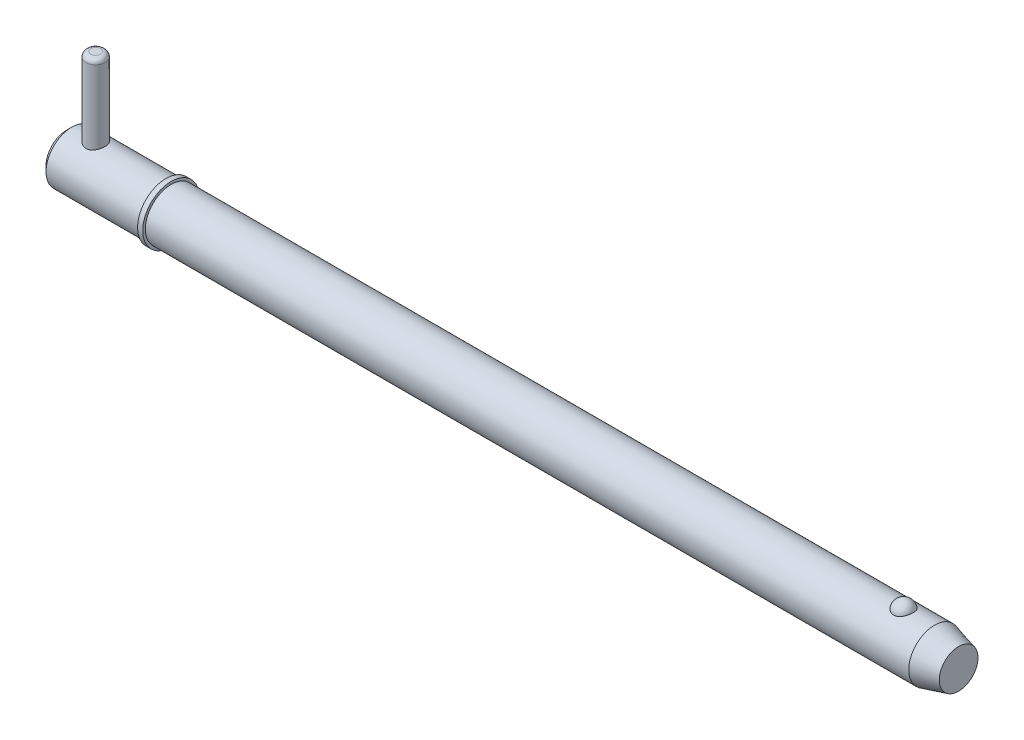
ISO-10303-21;
HEADER;
FILE_DESCRIPTION(('STEP AP214'),'2;1');
FILE_NAME('part.step','',(''),(''),'','','');
FILE_SCHEMA(('AUTOMOTIVE_DESIGN { 1 0 10303 214 1 1 1 1 }'));
ENDSEC;
DATA;
#1=APPLICATION_CONTEXT('core data for automotive mechanical design processes');
#2=APPLICATION_PROTOCOL_DEFINITION('international standard','automotive_design',2000,#1);
#3=PRODUCT_CONTEXT('',#1,'mechanical');
#4=PRODUCT('Part','Part','',(#3));
#5=PRODUCT_RELATED_PRODUCT_CATEGORY('part','',(#4));
#6=PRODUCT_DEFINITION_FORMATION('','',#4);
#7=PRODUCT_DEFINITION_CONTEXT('part definition',#1,'design');
#8=PRODUCT_DEFINITION('design','',#6,#7);
#9=PRODUCT_DEFINITION_SHAPE('','',#8);
#10=(LENGTH_UNIT() NAMED_UNIT(*) SI_UNIT(.MILLI.,.METRE.));
#11=(NAMED_UNIT(*) PLANE_ANGLE_UNIT() SI_UNIT($,.RADIAN.));
#12=(NAMED_UNIT(*) SI_UNIT($,.STERADIAN.) SOLID_ANGLE_UNIT());
#13=UNCERTAINTY_MEASURE_WITH_UNIT(LENGTH_MEASURE(1.E-05),#10,'distance_accuracy_value','');
#14=(GEOMETRIC_REPRESENTATION_CONTEXT(3) GLOBAL_UNCERTAINTY_ASSIGNED_CONTEXT((#13)) GLOBAL_UNIT_ASSIGNED_CONTEXT((#10,
#11,#12)) REPRESENTATION_CONTEXT('',''));
#15=CARTESIAN_POINT('',(0.,0.,0.));
#16=DIRECTION('',(0.,0.,1.));
#17=DIRECTION('',(1.,0.,0.));
#18=AXIS2_PLACEMENT_3D('',#15,#16,#17);
#19=CARTESIAN_POINT('',(7.14,25.4,0.));
#20=DIRECTION('',(0.,-1.,0.));
#21=DIRECTION('',(0.,0.,-1.));
#22=AXIS2_PLACEMENT_3D('',#19,#20,#21);
#23=CYLINDRICAL_SURFACE('',#22,2.38);
#24=CARTESIAN_POINT('',(7.14,-5.16,0.));
#25=DIRECTION('',(0.,1.,0.));
#26=DIRECTION('',(0.,0.,1.));
#27=AXIS2_PLACEMENT_3D('',#24,#25,#26);
#28=CIRCLE('',#27,2.38);
#29=CARTESIAN_POINT('',(7.14,-5.16,2.38));
#30=VERTEX_POINT('',#29);
#31=EDGE_CURVE('P0_E25',#30,#30,#28,.T.);
#32=ORIENTED_EDGE('',*,*,#31,.T.);
#33=EDGE_LOOP('',(#32));
#34=FACE_BOUND('',#33,.T.);
#35=CARTESIAN_POINT('',(7.14,24.21,0.));
#36=DIRECTION('',(0.,1.,0.));
#37=DIRECTION('',(0.,0.,1.));
#38=AXIS2_PLACEMENT_3D('',#35,#36,#37);
#39=CIRCLE('',#38,2.38);
#40=CARTESIAN_POINT('',(7.14,24.21,2.38));
#41=VERTEX_POINT('',#40);
#42=EDGE_CURVE('P0_E29',#41,#41,#39,.F.);
#43=ORIENTED_EDGE('',*,*,#42,.T.);
#44=EDGE_LOOP('',(#43));
#45=FACE_BOUND('',#44,.T.);
#46=ADVANCED_FACE('P0_F14',(#34,#45),#23,.T.);
#47=CARTESIAN_POINT('',(7.14,25.4,0.));
#48=DIRECTION('',(0.,1.,0.));
#49=DIRECTION('',(0.,0.,1.));
#50=AXIS2_PLACEMENT_3D('',#47,#48,#49);
#51=PLANE('',#50);
#52=CARTESIAN_POINT('',(7.14,25.4,0.));
#53=DIRECTION('',(0.,1.,0.));
#54=DIRECTION('',(0.,0.,1.));
#55=AXIS2_PLACEMENT_3D('',#52,#53,#54);
#56=CIRCLE('',#55,1.19);
#57=CARTESIAN_POINT('',(7.14,25.4,1.19));
#58=VERTEX_POINT('',#57);
#59=EDGE_CURVE('P0_E10',#58,#58,#56,.T.);
#60=ORIENTED_EDGE('',*,*,#59,.T.);
#61=EDGE_LOOP('',(#60));
#62=FACE_BOUND('',#61,.T.);
#63=ADVANCED_FACE('P0_F46',(#62),#51,.T.);
#64=CARTESIAN_POINT('',(7.14,-6.35,0.));
#65=DIRECTION('',(0.,1.,0.));
#66=DIRECTION('',(0.,0.,1.));
#67=AXIS2_PLACEMENT_3D('',#64,#65,#66);
#68=PLANE('',#67);
#69=CARTESIAN_POINT('',(7.14,-6.35,0.));
#70=DIRECTION('',(0.,1.,0.));
#71=DIRECTION('',(0.,0.,1.));
#72=AXIS2_PLACEMENT_3D('',#69,#70,#71);
#73=CIRCLE('',#72,1.19);
#74=CARTESIAN_POINT('',(7.14,-6.35,1.19));
#75=VERTEX_POINT('',#74);
#76=EDGE_CURVE('P0_E21',#75,#75,#73,.F.);
#77=ORIENTED_EDGE('',*,*,#76,.T.);
#78=EDGE_LOOP('',(#77));
#79=FACE_BOUND('',#78,.T.);
#80=ADVANCED_FACE('P0_F43',(#79),#68,.F.);
#81=CARTESIAN_POINT('',(7.14,-5.16,0.));
#82=DIRECTION('',(0.,1.,0.));
#83=DIRECTION('',(0.,0.,1.));
#84=AXIS2_PLACEMENT_3D('',#81,#82,#83);
#85=DEGENERATE_TOROIDAL_SURFACE('',#84,1.19,1.19,.T.);
#86=ORIENTED_EDGE('',*,*,#76,.F.);
#87=EDGE_LOOP('',(#86));
#88=FACE_BOUND('',#87,.T.);
#89=ORIENTED_EDGE('',*,*,#31,.F.);
#90=EDGE_LOOP('',(#89));
#91=FACE_BOUND('',#90,.T.);
#92=ADVANCED_FACE('P0_F38',(#88,#91),#85,.T.);
#93=CARTESIAN_POINT('',(7.14,24.21,0.));
#94=DIRECTION('',(0.,1.,0.));
#95=DIRECTION('',(0.,0.,1.));
#96=AXIS2_PLACEMENT_3D('',#93,#94,#95);
#97=DEGENERATE_TOROIDAL_SURFACE('',#96,1.19,1.19,.T.);
#98=ORIENTED_EDGE('',*,*,#42,.F.);
#99=EDGE_LOOP('',(#98));
#100=FACE_BOUND('',#99,.T.);
#101=ORIENTED_EDGE('',*,*,#59,.F.);
#102=EDGE_LOOP('',(#101));
#103=FACE_BOUND('',#102,.T.);
#104=ADVANCED_FACE('P0_F16',(#100,#103),#97,.T.);
#105=CLOSED_SHELL('',(#46,#63,#80,#92,#104));
#106=MANIFOLD_SOLID_BREP('P0_B1',#105);
#107=CARTESIAN_POINT('',(0.,0.,0.));
#108=DIRECTION('',(1.,0.,0.));
#109=DIRECTION('',(0.,0.,-1.));
#110=AXIS2_PLACEMENT_3D('',#107,#108,#109);
#111=CYLINDRICAL_SURFACE('',#110,6.35);
#112=CARTESIAN_POINT('',(213.455369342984,0.,0.));
#113=DIRECTION('',(1.,0.,0.));
#114=DIRECTION('',(0.,0.,-1.));
#115=AXIS2_PLACEMENT_3D('',#112,#113,#114);
#116=CIRCLE('',#115,6.35);
#117=CARTESIAN_POINT('',(213.455369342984,0.,-6.35));
#118=VERTEX_POINT('',#117);
#119=EDGE_CURVE('P1_E81',#118,#118,#116,.T.);
#120=ORIENTED_EDGE('',*,*,#119,.F.);
#121=EDGE_LOOP('',(#120));
#122=FACE_BOUND('',#121,.T.);
#123=CARTESIAN_POINT('',(25.7,0.,0.));
#124=DIRECTION('',(1.,0.,0.));
#125=DIRECTION('',(0.,0.,-1.));
#126=AXIS2_PLACEMENT_3D('',#123,#124,#125);
#127=CIRCLE('',#126,6.35);
#128=CARTESIAN_POINT('',(25.7,0.,-6.35));
#129=VERTEX_POINT('',#128);
#130=EDGE_CURVE('P1_E85',#129,#129,#127,.T.);
#131=ORIENTED_EDGE('',*,*,#130,.T.);
#132=EDGE_LOOP('',(#131));
#133=FACE_BOUND('',#132,.T.);
#134=CARTESIAN_POINT('',(205.830021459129,5.87502187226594,2.40969251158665));
#135=CARTESIAN_POINT('',(205.705030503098,5.87501645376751,2.40969773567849));
#136=CARTESIAN_POINT('',(205.580080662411,5.87916061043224,2.39967292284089));
#137=CARTESIAN_POINT('',(205.333909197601,5.89523112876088,2.35991730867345));
#138=CARTESIAN_POINT('',(205.212686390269,5.90715499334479,2.33019283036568));
#139=CARTESIAN_POINT('',(204.977517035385,5.93739567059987,2.25201402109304));
#140=CARTESIAN_POINT('',(204.863560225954,5.95570321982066,2.20358681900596));
#141=CARTESIAN_POINT('',(204.64557352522,5.99672067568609,2.08937987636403));
#142=CARTESIAN_POINT('',(204.541545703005,6.0194314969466,2.02359652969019));
#143=CARTESIAN_POINT('',(204.342943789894,6.06760647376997,1.87428969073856));
#144=CARTESIAN_POINT('',(204.248726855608,6.09313095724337,1.79031110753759));
#145=CARTESIAN_POINT('',(204.075255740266,6.14375873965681,1.6080017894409));
#146=CARTESIAN_POINT('',(203.996004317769,6.16886196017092,1.50966841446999));
#147=CARTESIAN_POINT('',(203.850845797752,6.21724600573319,1.29645884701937));
#148=CARTESIAN_POINT('',(203.785688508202,6.24039621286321,1.1810415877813));
#149=CARTESIAN_POINT('',(203.674703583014,6.28117277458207,0.940351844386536));
#150=CARTESIAN_POINT('',(203.628877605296,6.29879865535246,0.815078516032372));
#151=CARTESIAN_POINT('',(203.557023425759,6.32692073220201,0.556494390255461));
#152=CARTESIAN_POINT('',(203.531249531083,6.33732517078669,0.423102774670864));
#153=CARTESIAN_POINT('',(203.500988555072,6.34957673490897,0.153542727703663));
#154=CARTESIAN_POINT('',(203.496500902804,6.35142408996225,0.0173743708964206));
#155=CARTESIAN_POINT('',(203.508865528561,6.34638925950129,-0.253036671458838));
#156=CARTESIAN_POINT('',(203.525594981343,6.33955731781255,-0.387285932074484));
#157=CARTESIAN_POINT('',(203.579843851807,6.31794129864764,-0.650851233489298));
#158=CARTESIAN_POINT('',(203.617363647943,6.3031570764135,-0.780167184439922));
#159=CARTESIAN_POINT('',(203.712500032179,6.26711642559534,-1.03041949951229));
#160=CARTESIAN_POINT('',(203.770143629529,6.24585130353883,-1.15134433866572));
#161=CARTESIAN_POINT('',(203.904352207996,6.19905619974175,-1.38129800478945));
#162=CARTESIAN_POINT('',(203.980918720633,6.17352587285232,-1.49032586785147));
#163=CARTESIAN_POINT('',(204.151753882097,6.12080227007,-1.69393164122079));
#164=CARTESIAN_POINT('',(204.246100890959,6.09360200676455,-1.78844209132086));
#165=CARTESIAN_POINT('',(204.450119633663,6.04070434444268,-1.95970536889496));
#166=CARTESIAN_POINT('',(204.559790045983,6.015006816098,-2.0364597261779));
#167=CARTESIAN_POINT('',(204.789187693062,5.96867714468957,-2.16845644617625));
#168=CARTESIAN_POINT('',(204.908652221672,5.94794910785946,-2.22412062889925));
#169=CARTESIAN_POINT('',(205.156218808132,5.91340580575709,-2.31440992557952));
#170=CARTESIAN_POINT('',(205.284317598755,5.89958794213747,-2.34904294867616));
#171=CARTESIAN_POINT('',(205.538582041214,5.88111049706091,-2.39491590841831));
#172=CARTESIAN_POINT('',(205.664520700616,5.87602512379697,-2.40724512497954));
#173=CARTESIAN_POINT('',(205.916786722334,5.87428980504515,-2.41147867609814));
#174=CARTESIAN_POINT('',(206.043114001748,5.8776381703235,-2.40338710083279));
#175=CARTESIAN_POINT('',(206.288417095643,5.89212921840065,-2.36762715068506));
#176=CARTESIAN_POINT('',(206.407499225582,5.90302431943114,-2.3405803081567));
#177=CARTESIAN_POINT('',(206.63924472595,5.93113752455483,-2.26839066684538));
#178=CARTESIAN_POINT('',(206.751907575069,5.94835614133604,-2.22324640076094));
#179=CARTESIAN_POINT('',(206.970400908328,5.9877301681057,-2.11493806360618));
#180=CARTESIAN_POINT('',(207.076028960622,6.00998499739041,-2.0514026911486));
#181=CARTESIAN_POINT('',(207.275300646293,6.05690144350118,-1.90842705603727));
#182=CARTESIAN_POINT('',(207.368941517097,6.08156361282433,-1.82898313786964));
#183=CARTESIAN_POINT('',(207.546675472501,6.13211715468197,-1.65182429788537));
#184=CARTESIAN_POINT('',(207.630055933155,6.15800825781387,-1.5533938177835));
#185=CARTESIAN_POINT('',(207.779790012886,6.20712834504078,-1.34374214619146));
#186=CARTESIAN_POINT('',(207.846140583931,6.23035685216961,-1.23251867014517));
#187=CARTESIAN_POINT('',(207.962345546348,6.27251177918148,-0.996447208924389));
#188=CARTESIAN_POINT('',(208.011607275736,6.29127762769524,-0.871278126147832));
#189=CARTESIAN_POINT('',(208.089614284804,6.3215862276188,-0.613870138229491));
#190=CARTESIAN_POINT('',(208.118359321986,6.33312889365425,-0.481631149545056));
#191=CARTESIAN_POINT('',(208.154770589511,6.34782349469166,-0.213672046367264));
#192=CARTESIAN_POINT('',(208.162413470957,6.35096613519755,-0.0779482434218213));
#193=CARTESIAN_POINT('',(208.156395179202,6.34851322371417,0.192943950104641));
#194=CARTESIAN_POINT('',(208.142734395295,6.3429178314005,0.328112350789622));
#195=CARTESIAN_POINT('',(208.09450361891,6.32360512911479,0.593406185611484));
#196=CARTESIAN_POINT('',(208.060031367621,6.30992579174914,0.723552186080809));
#197=CARTESIAN_POINT('',(207.970953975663,6.27586325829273,0.97583417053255));
#198=CARTESIAN_POINT('',(207.91634761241,6.25547965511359,1.09796966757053));
#199=CARTESIAN_POINT('',(207.78775879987,6.20998183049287,1.33148921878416));
#200=CARTESIAN_POINT('',(207.713674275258,6.18484288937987,1.44281227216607));
#201=CARTESIAN_POINT('',(207.547820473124,6.13258735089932,1.65087683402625));
#202=CARTESIAN_POINT('',(207.456051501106,6.10547078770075,1.74761859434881));
#203=CARTESIAN_POINT('',(207.257183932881,6.05235879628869,1.92350926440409));
#204=CARTESIAN_POINT('',(207.150133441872,6.02636017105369,2.00271146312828));
#205=CARTESIAN_POINT('',(206.923138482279,5.97843747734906,2.14154159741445));
#206=CARTESIAN_POINT('',(206.803191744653,5.9565141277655,2.20116608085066));
#207=CARTESIAN_POINT('',(206.544523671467,5.91812106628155,2.30250570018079));
#208=CARTESIAN_POINT('',(206.40506980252,5.90217533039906,2.34256795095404));
#209=CARTESIAN_POINT('',(206.120397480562,5.88063128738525,2.3961521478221));
#210=CARTESIAN_POINT('',(205.97518174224,5.87502816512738,2.40968644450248));
#211=CARTESIAN_POINT('',(205.830021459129,5.87502187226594,2.40969251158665));
#212=B_SPLINE_CURVE_WITH_KNOTS('',3,(#134,#135,#136,#137,#138,#139,#140,#141,#142,#143,#144,
#145,#146,#147,#148,#149,#150,#151,#152,#153,#154,#155,#156,#157,#158,#159,#160,#161,#162,#163,
#164,#165,#166,#167,#168,#169,#170,#171,#172,#173,#174,#175,#176,#177,#178,#179,#180,#181,#182,
#183,#184,#185,#186,#187,#188,#189,#190,#191,#192,#193,#194,#195,#196,#197,#198,#199,#200,#201,
#202,#203,#204,#205,#206,#207,#208,#209,#210,#211),.UNSPECIFIED.,.T.,.F.,(4,2,2,2,2,2,2,2,2,2,2,
2,2,2,2,2,2,2,2,2,2,2,2,2,2,2,2,2,2,2,2,2,2,2,2,2,2,2,4),(0.,0.374440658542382,
0.748761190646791,1.122540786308,1.4963981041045,1.88098871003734,2.26565013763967,
2.66741104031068,3.06920639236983,3.47601794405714,3.88281858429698,4.28727498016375,
4.69173873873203,5.09674745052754,5.50178895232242,5.90865911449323,6.31549420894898,
6.71369855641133,7.11175305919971,7.48978077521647,7.86773278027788,8.23383886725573,
8.59997464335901,8.97409044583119,9.34829231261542,9.74122667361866,10.1342313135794,
10.5397522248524,10.9452779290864,11.3512521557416,11.75721896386,12.1612938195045,
12.5653932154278,12.9716540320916,13.3779078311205,13.7829098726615,14.1879832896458,
14.6230486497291,15.0579114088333),.UNSPECIFIED.);
#213=CARTESIAN_POINT('',(205.830021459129,5.87502187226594,2.40969251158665));
#214=VERTEX_POINT('',#213);
#215=EDGE_CURVE('P1_E35',#214,#214,#212,.T.);
#216=ORIENTED_EDGE('',*,*,#215,.T.);
#217=EDGE_LOOP('',(#216));
#218=FACE_BOUND('',#217,.T.);
#219=ADVANCED_FACE('P1_F13',(#122,#133,#218),#111,.T.);
#220=CARTESIAN_POINT('',(0.,0.,0.));
#221=DIRECTION('',(-1.,0.,0.));
#222=DIRECTION('',(0.,0.,1.));
#223=AXIS2_PLACEMENT_3D('',#220,#221,#222);
#224=PLANE('',#223);
#225=CARTESIAN_POINT('',(0.,0.,0.));
#226=DIRECTION('',(1.,0.,0.));
#227=DIRECTION('',(0.,0.,-1.));
#228=AXIS2_PLACEMENT_3D('',#225,#226,#227);
#229=CIRCLE('',#228,5.08);
#230=CARTESIAN_POINT('',(0.,0.,-5.08));
#231=VERTEX_POINT('',#230);
#232=EDGE_CURVE('P1_E9',#231,#231,#229,.T.);
#233=ORIENTED_EDGE('',*,*,#232,.F.);
#234=EDGE_LOOP('',(#233));
#235=FACE_BOUND('',#234,.T.);
#236=ADVANCED_FACE('P1_F15',(#235),#224,.T.);
#237=CARTESIAN_POINT('',(1.27,0.,0.));
#238=DIRECTION('',(1.,0.,0.));
#239=DIRECTION('',(0.,0.,-1.));
#240=AXIS2_PLACEMENT_3D('',#237,#238,#239);
#241=CONICAL_SURFACE('',#240,6.35,0.78539816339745);
#242=ORIENTED_EDGE('',*,*,#232,.T.);
#243=EDGE_LOOP('',(#242));
#244=FACE_BOUND('',#243,.T.);
#245=CARTESIAN_POINT('',(1.27,0.,0.));
#246=DIRECTION('',(1.,0.,0.));
#247=DIRECTION('',(0.,0.,-1.));
#248=AXIS2_PLACEMENT_3D('',#245,#246,#247);
#249=CIRCLE('',#248,6.35);
#250=CARTESIAN_POINT('',(1.27,0.,-6.35));
#251=VERTEX_POINT('',#250);
#252=EDGE_CURVE('P1_E26',#251,#251,#249,.T.);
#253=ORIENTED_EDGE('',*,*,#252,.F.);
#254=EDGE_LOOP('',(#253));
#255=FACE_BOUND('',#254,.T.);
#256=ADVANCED_FACE('P1_F77',(#244,#255),#241,.T.);
#257=CARTESIAN_POINT('',(0.,0.,0.));
#258=DIRECTION('',(1.,0.,0.));
#259=DIRECTION('',(0.,0.,-1.));
#260=AXIS2_PLACEMENT_3D('',#257,#258,#259);
#261=CYLINDRICAL_SURFACE('',#260,6.35);
#262=CARTESIAN_POINT('',(7.14,-5.88711304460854,2.38));
#263=CARTESIAN_POINT('',(7.01146258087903,-5.88710856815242,2.38000480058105));
#264=CARTESIAN_POINT('',(6.88295682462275,-5.89136840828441,2.36955244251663));
#265=CARTESIAN_POINT('',(6.62981934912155,-5.90782785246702,2.32820953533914));
#266=CARTESIAN_POINT('',(6.50518751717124,-5.92002722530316,2.29731958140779));
#267=CARTESIAN_POINT('',(6.26352403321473,-5.95079384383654,2.21639366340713));
#268=CARTESIAN_POINT('',(6.14647496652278,-5.96934583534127,2.16640353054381));
#269=CARTESIAN_POINT('',(5.92237941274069,-6.01070278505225,2.04885862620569));
#270=CARTESIAN_POINT('',(5.81533593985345,-6.03350901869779,1.98129858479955));
#271=CARTESIAN_POINT('',(5.60897525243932,-6.08207341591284,1.82693902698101));
#272=CARTESIAN_POINT('',(5.51022503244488,-6.10791836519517,1.73940861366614));
#273=CARTESIAN_POINT('',(5.32840561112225,-6.15892405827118,1.54914379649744));
#274=CARTESIAN_POINT('',(5.24533975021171,-6.1840846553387,1.44640616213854));
#275=CARTESIAN_POINT('',(5.09451639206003,-6.23191821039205,1.22434014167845));
#276=CARTESIAN_POINT('',(5.02737511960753,-6.25447755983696,1.10456656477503));
#277=CARTESIAN_POINT('',(4.91443001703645,-6.2935236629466,0.854429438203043));
#278=CARTESIAN_POINT('',(4.86861879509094,-6.31001251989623,0.724069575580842));
#279=CARTESIAN_POINT('',(4.80162253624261,-6.33444370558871,0.46242122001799));
#280=CARTESIAN_POINT('',(4.77946137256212,-6.34272370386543,0.331414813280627));
#281=CARTESIAN_POINT('',(4.75726677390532,-6.35101600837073,0.0672982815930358));
#282=CARTESIAN_POINT('',(4.75722615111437,-6.35103100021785,-0.0658111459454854));
#283=CARTESIAN_POINT('',(4.77870510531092,-6.3430064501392,-0.323358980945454));
#284=CARTESIAN_POINT('',(4.79915922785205,-6.33536494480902,-0.447900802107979));
#285=CARTESIAN_POINT('',(4.85925493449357,-6.31340794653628,-0.69163609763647));
#286=CARTESIAN_POINT('',(4.89889787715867,-6.29909198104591,-0.810829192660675));
#287=CARTESIAN_POINT('',(4.9967414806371,-6.26494471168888,-1.04254212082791));
#288=CARTESIAN_POINT('',(5.05520370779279,-6.24503620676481,-1.1549396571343));
#289=CARTESIAN_POINT('',(5.1887948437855,-6.20171869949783,-1.3686079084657));
#290=CARTESIAN_POINT('',(5.26392912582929,-6.17830856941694,-1.46987502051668));
#291=CARTESIAN_POINT('',(5.43386591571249,-6.12878580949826,-1.66468415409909));
#292=CARTESIAN_POINT('',(5.52956139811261,-6.10259519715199,-1.75742857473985));
#293=CARTESIAN_POINT('',(5.73530435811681,-6.05155777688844,-1.92585331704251));
#294=CARTESIAN_POINT('',(5.84535542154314,-6.02671130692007,-2.00152936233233));
#295=CARTESIAN_POINT('',(6.07982989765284,-5.98068420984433,-2.13519109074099));
#296=CARTESIAN_POINT('',(6.20451768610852,-5.95959698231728,-2.19274775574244));
#297=CARTESIAN_POINT('',(6.4628145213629,-5.92455622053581,-2.28574558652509));
#298=CARTESIAN_POINT('',(6.59641856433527,-5.91059872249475,-2.32119904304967));
#299=CARTESIAN_POINT('',(6.86087441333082,-5.8923327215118,-2.36717069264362));
#300=CARTESIAN_POINT('',(6.99147192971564,-5.8875347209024,-2.37895573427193));
#301=CARTESIAN_POINT('',(7.25283805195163,-5.88674545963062,-2.38091046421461));
#302=CARTESIAN_POINT('',(7.38360660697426,-5.89075200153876,-2.37108554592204));
#303=CARTESIAN_POINT('',(7.63510696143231,-5.90662331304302,-2.33124781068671));
#304=CARTESIAN_POINT('',(7.75602069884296,-5.91810660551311,-2.30221396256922));
#305=CARTESIAN_POINT('',(7.99120505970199,-5.94718527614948,-2.22601401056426));
#306=CARTESIAN_POINT('',(8.10547431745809,-5.96478190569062,-2.17884419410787));
#307=CARTESIAN_POINT('',(8.32888632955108,-6.00491533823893,-2.06572311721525));
#308=CARTESIAN_POINT('',(8.43767672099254,-6.02761250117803,-1.99913452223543));
#309=CARTESIAN_POINT('',(8.6429894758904,-6.07511988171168,-1.84974438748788));
#310=CARTESIAN_POINT('',(8.73950733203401,-6.09993087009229,-1.76693691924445));
#311=CARTESIAN_POINT('',(8.9238741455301,-6.1507686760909,-1.58125563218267));
#312=CARTESIAN_POINT('',(9.01078732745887,-6.17677301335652,-1.47744327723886));
#313=CARTESIAN_POINT('',(9.16607127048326,-6.22556172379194,-1.25606967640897));
#314=CARTESIAN_POINT('',(9.23444197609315,-6.24834608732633,-1.13850838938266));
#315=CARTESIAN_POINT('',(9.3502493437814,-6.28811144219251,-0.893050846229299));
#316=CARTESIAN_POINT('',(9.39775808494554,-6.30511236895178,-0.765192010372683));
#317=CARTESIAN_POINT('',(9.47032640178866,-6.33145833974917,-0.502514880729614));
#318=CARTESIAN_POINT('',(9.49539651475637,-6.34080697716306,-0.367699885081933));
#319=CARTESIAN_POINT('',(9.52124059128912,-6.35045496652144,-0.103396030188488));
#320=CARTESIAN_POINT('',(9.52334421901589,-6.35124952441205,0.025945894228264));
#321=CARTESIAN_POINT('',(9.50661518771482,-6.34499064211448,0.283061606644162));
#322=CARTESIAN_POINT('',(9.48778504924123,-6.33793814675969,0.410835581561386));
#323=CARTESIAN_POINT('',(9.43065630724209,-6.31700307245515,0.658028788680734));
#324=CARTESIAN_POINT('',(9.39284291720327,-6.30329098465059,0.7775756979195));
#325=CARTESIAN_POINT('',(9.29930406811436,-6.27046903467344,1.00863789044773));
#326=CARTESIAN_POINT('',(9.2435752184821,-6.25135815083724,1.12015164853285));
#327=CARTESIAN_POINT('',(9.11312349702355,-6.20865254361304,1.33711407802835));
#328=CARTESIAN_POINT('',(9.03770094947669,-6.18490316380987,1.44211105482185));
#329=CARTESIAN_POINT('',(8.87110640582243,-6.13583718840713,1.63836897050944));
#330=CARTESIAN_POINT('',(8.77992879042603,-6.11052003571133,1.72962498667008));
#331=CARTESIAN_POINT('',(8.57869799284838,-6.05953829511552,1.90076098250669));
#332=CARTESIAN_POINT('',(8.46790320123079,-6.03392573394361,1.97978778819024));
#333=CARTESIAN_POINT('',(8.23379693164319,-5.98676607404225,2.11813466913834));
#334=CARTESIAN_POINT('',(8.11048418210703,-5.9652193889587,2.17745273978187));
#335=CARTESIAN_POINT('',(7.84900037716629,-5.92818393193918,2.27641807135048));
#336=CARTESIAN_POINT('',(7.71041678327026,-5.91299857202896,2.31510015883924));
#337=CARTESIAN_POINT('',(7.42787316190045,-5.89246887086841,2.36688002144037));
#338=CARTESIAN_POINT('',(7.28391673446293,-5.88711805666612,2.37999462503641));
#339=CARTESIAN_POINT('',(7.14,-5.88711304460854,2.38));
#340=B_SPLINE_CURVE_WITH_KNOTS('',3,(#262,#263,#264,#265,#266,#267,#268,#269,#270,#271,#272,
#273,#274,#275,#276,#277,#278,#279,#280,#281,#282,#283,#284,#285,#286,#287,#288,#289,#290,#291,
#292,#293,#294,#295,#296,#297,#298,#299,#300,#301,#302,#303,#304,#305,#306,#307,#308,#309,#310,
#311,#312,#313,#314,#315,#316,#317,#318,#319,#320,#321,#322,#323,#324,#325,#326,#327,#328,#329,
#330,#331,#332,#333,#334,#335,#336,#337,#338,#339),.UNSPECIFIED.,.T.,.F.,(4,2,2,2,2,2,2,2,2,2,2,
2,2,2,2,2,2,2,2,2,2,2,2,2,2,2,2,2,2,2,2,2,2,2,2,2,2,2,4),(0.,0.385076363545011,
0.770141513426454,1.15428843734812,1.53855071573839,1.94016118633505,2.3418570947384,
2.75720522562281,3.1724093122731,3.569721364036,3.96690431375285,4.34445758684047,
4.72203759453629,5.10511017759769,5.48830640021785,5.89390240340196,6.29959991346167,
6.71428455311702,7.12873839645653,7.52034494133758,7.91185376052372,8.28480528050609,
8.65783318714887,9.0448340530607,9.43197664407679,9.84363087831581,10.2552863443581,
10.6655081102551,11.0755371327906,11.4616919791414,11.847800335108,12.224507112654,
12.6012852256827,12.9938941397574,13.386643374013,13.8000944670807,14.2135876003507,
14.6450218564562,15.0761720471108),.UNSPECIFIED.);
#341=CARTESIAN_POINT('',(7.14,-5.88711304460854,2.38));
#342=VERTEX_POINT('',#341);
#343=EDGE_CURVE('P1_E17',#342,#342,#340,.T.);
#344=ORIENTED_EDGE('',*,*,#343,.F.);
#345=EDGE_LOOP('',(#344));
#346=FACE_BOUND('',#345,.T.);
#347=CARTESIAN_POINT('',(7.14,5.88711304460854,2.38));
#348=CARTESIAN_POINT('',(7.26853741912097,5.88710856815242,2.38000480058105));
#349=CARTESIAN_POINT('',(7.39704317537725,5.89136840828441,2.36955244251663));
#350=CARTESIAN_POINT('',(7.65018065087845,5.90782785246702,2.32820953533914));
#351=CARTESIAN_POINT('',(7.77481248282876,5.92002722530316,2.29731958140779));
#352=CARTESIAN_POINT('',(8.01647596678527,5.95079384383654,2.21639366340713));
#353=CARTESIAN_POINT('',(8.13352503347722,5.96934583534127,2.16640353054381));
#354=CARTESIAN_POINT('',(8.35762058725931,6.01070278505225,2.04885862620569));
#355=CARTESIAN_POINT('',(8.46466406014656,6.03350901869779,1.98129858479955));
#356=CARTESIAN_POINT('',(8.67102474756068,6.08207341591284,1.82693902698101));
#357=CARTESIAN_POINT('',(8.76977496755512,6.10791836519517,1.73940861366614));
#358=CARTESIAN_POINT('',(8.95159438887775,6.15892405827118,1.54914379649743));
#359=CARTESIAN_POINT('',(9.03466024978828,6.1840846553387,1.44640616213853));
#360=CARTESIAN_POINT('',(9.18548360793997,6.23191821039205,1.22434014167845));
#361=CARTESIAN_POINT('',(9.25262488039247,6.25447755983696,1.10456656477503));
#362=CARTESIAN_POINT('',(9.36556998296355,6.2935236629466,0.854429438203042));
#363=CARTESIAN_POINT('',(9.41138120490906,6.31001251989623,0.72406957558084));
#364=CARTESIAN_POINT('',(9.47837746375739,6.33444370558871,0.462421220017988));
#365=CARTESIAN_POINT('',(9.50053862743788,6.34272370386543,0.331414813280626));
#366=CARTESIAN_POINT('',(9.52273322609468,6.35101600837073,0.0672982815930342));
#367=CARTESIAN_POINT('',(9.52277384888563,6.35103100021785,-0.0658111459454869));
#368=CARTESIAN_POINT('',(9.50129489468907,6.3430064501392,-0.323358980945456));
#369=CARTESIAN_POINT('',(9.48084077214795,6.33536494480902,-0.447900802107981));
#370=CARTESIAN_POINT('',(9.42074506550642,6.31340794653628,-0.691636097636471));
#371=CARTESIAN_POINT('',(9.38110212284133,6.29909198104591,-0.810829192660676));
#372=CARTESIAN_POINT('',(9.2832585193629,6.26494471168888,-1.04254212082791));
#373=CARTESIAN_POINT('',(9.22479629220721,6.24503620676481,-1.1549396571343));
#374=CARTESIAN_POINT('',(9.0912051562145,6.20171869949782,-1.3686079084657));
#375=CARTESIAN_POINT('',(9.0160708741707,6.17830856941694,-1.46987502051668));
#376=CARTESIAN_POINT('',(8.84613408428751,6.12878580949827,-1.66468415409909));
#377=CARTESIAN_POINT('',(8.75043860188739,6.10259519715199,-1.75742857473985));
#378=CARTESIAN_POINT('',(8.54469564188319,6.05155777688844,-1.92585331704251));
#379=CARTESIAN_POINT('',(8.43464457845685,6.02671130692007,-2.00152936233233));
#380=CARTESIAN_POINT('',(8.20017010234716,5.98068420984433,-2.13519109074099));
#381=CARTESIAN_POINT('',(8.07548231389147,5.95959698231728,-2.19274775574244));
#382=CARTESIAN_POINT('',(7.8171854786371,5.9245562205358,-2.28574558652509));
#383=CARTESIAN_POINT('',(7.68358143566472,5.91059872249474,-2.32119904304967));
#384=CARTESIAN_POINT('',(7.41912558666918,5.8923327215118,-2.36717069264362));
#385=CARTESIAN_POINT('',(7.28852807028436,5.8875347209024,-2.37895573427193));
#386=CARTESIAN_POINT('',(7.02716194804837,5.88674545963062,-2.38091046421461));
#387=CARTESIAN_POINT('',(6.89639339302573,5.89075200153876,-2.37108554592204));
#388=CARTESIAN_POINT('',(6.64489303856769,5.90662331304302,-2.33124781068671));
#389=CARTESIAN_POINT('',(6.52397930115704,5.91810660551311,-2.30221396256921));
#390=CARTESIAN_POINT('',(6.288794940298,5.94718527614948,-2.22601401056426));
#391=CARTESIAN_POINT('',(6.17452568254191,5.96478190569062,-2.17884419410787));
#392=CARTESIAN_POINT('',(5.95111367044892,6.00491533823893,-2.06572311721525));
#393=CARTESIAN_POINT('',(5.84232327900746,6.02761250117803,-1.99913452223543));
#394=CARTESIAN_POINT('',(5.6370105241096,6.07511988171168,-1.84974438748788));
#395=CARTESIAN_POINT('',(5.54049266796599,6.09993087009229,-1.76693691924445));
#396=CARTESIAN_POINT('',(5.3561258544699,6.1507686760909,-1.58125563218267));
#397=CARTESIAN_POINT('',(5.26921267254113,6.17677301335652,-1.47744327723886));
#398=CARTESIAN_POINT('',(5.11392872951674,6.22556172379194,-1.25606967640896));
#399=CARTESIAN_POINT('',(5.04555802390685,6.24834608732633,-1.13850838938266));
#400=CARTESIAN_POINT('',(4.9297506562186,6.28811144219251,-0.893050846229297));
#401=CARTESIAN_POINT('',(4.88224191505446,6.30511236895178,-0.76519201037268));
#402=CARTESIAN_POINT('',(4.80967359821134,6.33145833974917,-0.502514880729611));
#403=CARTESIAN_POINT('',(4.78460348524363,6.34080697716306,-0.36769988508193));
#404=CARTESIAN_POINT('',(4.75875940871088,6.35045496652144,-0.103396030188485));
#405=CARTESIAN_POINT('',(4.75665578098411,6.35124952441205,0.025945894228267));
#406=CARTESIAN_POINT('',(4.77338481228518,6.34499064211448,0.283061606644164));
#407=CARTESIAN_POINT('',(4.79221495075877,6.33793814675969,0.410835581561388));
#408=CARTESIAN_POINT('',(4.84934369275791,6.31700307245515,0.658028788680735));
#409=CARTESIAN_POINT('',(4.88715708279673,6.30329098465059,0.777575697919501));
#410=CARTESIAN_POINT('',(4.98069593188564,6.27046903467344,1.00863789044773));
#411=CARTESIAN_POINT('',(5.0364247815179,6.25135815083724,1.12015164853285));
#412=CARTESIAN_POINT('',(5.16687650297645,6.20865254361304,1.33711407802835));
#413=CARTESIAN_POINT('',(5.24229905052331,6.18490316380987,1.44211105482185));
#414=CARTESIAN_POINT('',(5.40889359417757,6.13583718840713,1.63836897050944));
#415=CARTESIAN_POINT('',(5.50007120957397,6.11052003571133,1.72962498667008));
#416=CARTESIAN_POINT('',(5.70130200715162,6.05953829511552,1.90076098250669));
#417=CARTESIAN_POINT('',(5.81209679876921,6.03392573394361,1.97978778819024));
#418=CARTESIAN_POINT('',(6.04620306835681,5.98676607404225,2.11813466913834));
#419=CARTESIAN_POINT('',(6.16951581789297,5.9652193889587,2.17745273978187));
#420=CARTESIAN_POINT('',(6.43099962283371,5.92818393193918,2.27641807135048));
#421=CARTESIAN_POINT('',(6.56958321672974,5.91299857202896,2.31510015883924));
#422=CARTESIAN_POINT('',(6.85212683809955,5.89246887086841,2.36688002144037));
#423=CARTESIAN_POINT('',(6.99608326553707,5.88711805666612,2.37999462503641));
#424=CARTESIAN_POINT('',(7.14,5.88711304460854,2.38));
#425=B_SPLINE_CURVE_WITH_KNOTS('',3,(#347,#348,#349,#350,#351,#352,#353,#354,#355,#356,#357,
#358,#359,#360,#361,#362,#363,#364,#365,#366,#367,#368,#369,#370,#371,#372,#373,#374,#375,#376,
#377,#378,#379,#380,#381,#382,#383,#384,#385,#386,#387,#388,#389,#390,#391,#392,#393,#394,#395,
#396,#397,#398,#399,#400,#401,#402,#403,#404,#405,#406,#407,#408,#409,#410,#411,#412,#413,#414,
#415,#416,#417,#418,#419,#420,#421,#422,#423,#424),.UNSPECIFIED.,.T.,.F.,(4,2,2,2,2,2,2,2,2,2,2,
2,2,2,2,2,2,2,2,2,2,2,2,2,2,2,2,2,2,2,2,2,2,2,2,2,2,2,4),(0.,0.385076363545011,
0.770141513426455,1.15428843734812,1.53855071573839,1.94016118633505,2.3418570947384,
2.75720522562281,3.1724093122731,3.56972136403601,3.96690431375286,4.34445758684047,
4.72203759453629,5.10511017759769,5.48830640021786,5.89390240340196,6.29959991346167,
6.71428455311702,7.12873839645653,7.52034494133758,7.91185376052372,8.2848052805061,
8.65783318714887,9.0448340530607,9.43197664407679,9.84363087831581,10.2552863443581,
10.6655081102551,11.0755371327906,11.4616919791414,11.847800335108,12.2245071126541,
12.6012852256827,12.9938941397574,13.386643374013,13.8000944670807,14.2135876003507,
14.6450218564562,15.0761720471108),.UNSPECIFIED.);
#426=CARTESIAN_POINT('',(7.14,5.88711304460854,2.38));
#427=VERTEX_POINT('',#426);
#428=EDGE_CURVE('P1_E43',#427,#427,#425,.T.);
#429=ORIENTED_EDGE('',*,*,#428,.F.);
#430=EDGE_LOOP('',(#429));
#431=FACE_BOUND('',#430,.T.);
#432=ORIENTED_EDGE('',*,*,#252,.T.);
#433=EDGE_LOOP('',(#432));
#434=FACE_BOUND('',#433,.T.);
#435=CARTESIAN_POINT('',(24.43,0.,0.));
#436=DIRECTION('',(1.,0.,0.));
#437=DIRECTION('',(0.,0.,-1.));
#438=AXIS2_PLACEMENT_3D('',#435,#436,#437);
#439=CIRCLE('',#438,6.35);
#440=CARTESIAN_POINT('',(24.43,0.,-6.35));
#441=VERTEX_POINT('',#440);
#442=EDGE_CURVE('P1_E31',#441,#441,#439,.T.);
#443=ORIENTED_EDGE('',*,*,#442,.F.);
#444=EDGE_LOOP('',(#443));
#445=FACE_BOUND('',#444,.T.);
#446=ADVANCED_FACE('P1_F103',(#346,#431,#434,#445),#261,.T.);
#447=CARTESIAN_POINT('',(24.43,6.35,0.));
#448=DIRECTION('',(-1.,0.,0.));
#449=DIRECTION('',(0.,0.,1.));
#450=AXIS2_PLACEMENT_3D('',#447,#448,#449);
#451=PLANE('',#450);
#452=ORIENTED_EDGE('',*,*,#442,.T.);
#453=EDGE_LOOP('',(#452));
#454=FACE_BOUND('',#453,.T.);
#455=CARTESIAN_POINT('',(24.43,0.,0.));
#456=DIRECTION('',(1.,0.,0.));
#457=DIRECTION('',(0.,0.,-1.));
#458=AXIS2_PLACEMENT_3D('',#455,#456,#457);
#459=CIRCLE('',#458,6.985);
#460=CARTESIAN_POINT('',(24.43,0.,-6.985));
#461=VERTEX_POINT('',#460);
#462=EDGE_CURVE('P1_E91',#461,#461,#459,.T.);
#463=ORIENTED_EDGE('',*,*,#462,.F.);
#464=EDGE_LOOP('',(#463));
#465=FACE_BOUND('',#464,.T.);
#466=ADVANCED_FACE('P1_F100',(#454,#465),#451,.T.);
#467=CARTESIAN_POINT('',(0.,0.,0.));
#468=DIRECTION('',(1.,0.,0.));
#469=DIRECTION('',(0.,0.,-1.));
#470=AXIS2_PLACEMENT_3D('',#467,#468,#469);
#471=CYLINDRICAL_SURFACE('',#470,6.985);
#472=ORIENTED_EDGE('',*,*,#462,.T.);
#473=EDGE_LOOP('',(#472));
#474=FACE_BOUND('',#473,.T.);
#475=CARTESIAN_POINT('',(25.7,0.,0.));
#476=DIRECTION('',(1.,0.,0.));
#477=DIRECTION('',(0.,0.,-1.));
#478=AXIS2_PLACEMENT_3D('',#475,#476,#477);
#479=CIRCLE('',#478,6.985);
#480=CARTESIAN_POINT('',(25.7,0.,-6.985));
#481=VERTEX_POINT('',#480);
#482=EDGE_CURVE('P1_E88',#481,#481,#479,.T.);
#483=ORIENTED_EDGE('',*,*,#482,.F.);
#484=EDGE_LOOP('',(#483));
#485=FACE_BOUND('',#484,.T.);
#486=ADVANCED_FACE('P1_F68',(#474,#485),#471,.T.);
#487=CARTESIAN_POINT('',(25.7,6.985,0.));
#488=DIRECTION('',(1.,0.,0.));
#489=DIRECTION('',(0.,0.,-1.));
#490=AXIS2_PLACEMENT_3D('',#487,#488,#489);
#491=PLANE('',#490);
#492=ORIENTED_EDGE('',*,*,#482,.T.);
#493=EDGE_LOOP('',(#492));
#494=FACE_BOUND('',#493,.T.);
#495=ORIENTED_EDGE('',*,*,#130,.F.);
#496=EDGE_LOOP('',(#495));
#497=FACE_BOUND('',#496,.T.);
#498=ADVANCED_FACE('P1_F62',(#494,#497),#491,.T.);
#499=CARTESIAN_POINT('',(219.38,0.,0.));
#500=DIRECTION('',(-1.,0.,0.));
#501=DIRECTION('',(0.,0.,1.));
#502=AXIS2_PLACEMENT_3D('',#499,#500,#501);
#503=CONICAL_SURFACE('',#502,4.76250000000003,0.261799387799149);
#504=ORIENTED_EDGE('',*,*,#119,.T.);
#505=EDGE_LOOP('',(#504));
#506=FACE_BOUND('',#505,.T.);
#507=CARTESIAN_POINT('',(219.38,0.,0.));
#508=DIRECTION('',(1.,0.,0.));
#509=DIRECTION('',(0.,0.,-1.));
#510=AXIS2_PLACEMENT_3D('',#507,#508,#509);
#511=CIRCLE('',#510,4.76250000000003);
#512=CARTESIAN_POINT('',(219.38,0.,-4.76250000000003));
#513=VERTEX_POINT('',#512);
#514=EDGE_CURVE('P1_E42',#513,#513,#511,.T.);
#515=ORIENTED_EDGE('',*,*,#514,.F.);
#516=EDGE_LOOP('',(#515));
#517=FACE_BOUND('',#516,.T.);
#518=ADVANCED_FACE('P1_F59',(#506,#517),#503,.T.);
#519=CARTESIAN_POINT('',(219.38,4.76250000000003,0.));
#520=DIRECTION('',(1.,0.,0.));
#521=DIRECTION('',(0.,0.,-1.));
#522=AXIS2_PLACEMENT_3D('',#519,#520,#521);
#523=PLANE('',#522);
#524=ORIENTED_EDGE('',*,*,#514,.T.);
#525=EDGE_LOOP('',(#524));
#526=FACE_BOUND('',#525,.T.);
#527=ADVANCED_FACE('P1_F55',(#526),#523,.T.);
#528=CARTESIAN_POINT('',(205.830021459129,5.715,0.));
#529=DIRECTION('',(-1.,0.,0.));
#530=DIRECTION('',(0.,1.,0.));
#531=AXIS2_PLACEMENT_3D('',#528,#529,#530);
#532=SPHERICAL_SURFACE('',#531,2.41500000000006);
#533=ORIENTED_EDGE('',*,*,#215,.F.);
#534=EDGE_LOOP('',(#533));
#535=FACE_BOUND('',#534,.T.);
#536=ADVANCED_FACE('P1_F50',(#535),#532,.T.);
#537=CARTESIAN_POINT('',(7.14,-6.985,0.));
#538=DIRECTION('',(0.,1.,0.));
#539=DIRECTION('',(0.,0.,1.));
#540=AXIS2_PLACEMENT_3D('',#537,#538,#539);
#541=CYLINDRICAL_SURFACE('',#540,2.38);
#542=ORIENTED_EDGE('',*,*,#343,.T.);
#543=EDGE_LOOP('',(#542));
#544=FACE_BOUND('',#543,.T.);
#545=ORIENTED_EDGE('',*,*,#428,.T.);
#546=EDGE_LOOP('',(#545));
#547=FACE_BOUND('',#546,.T.);
#548=ADVANCED_FACE('P1_F54',(#544,#547),#541,.F.);
#549=CLOSED_SHELL('',(#219,#236,#256,#446,#466,#486,#498,#518,#527,#536,#548));
#550=MANIFOLD_SOLID_BREP('P1_B1',#549);
#551=ADVANCED_BREP_SHAPE_REPRESENTATION('',(#18,#106,#550),#14);
#552=SHAPE_DEFINITION_REPRESENTATION(#9,#551);
ENDSEC;
END-ISO-10303-21;
